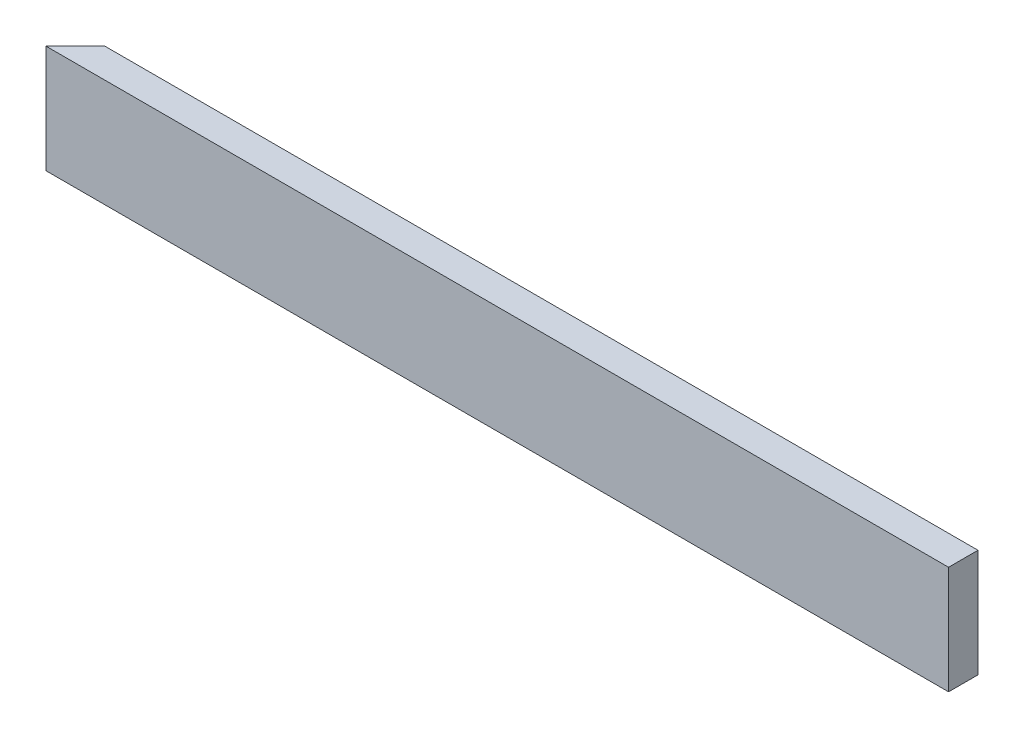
ISO-10303-21;
HEADER;
FILE_DESCRIPTION(('STEP AP214'),'2;1');
FILE_NAME('part.step','',(''),(''),'','','');
FILE_SCHEMA(('AUTOMOTIVE_DESIGN { 1 0 10303 214 1 1 1 1 }'));
ENDSEC;
DATA;
#1=APPLICATION_CONTEXT('core data for automotive mechanical design processes');
#2=APPLICATION_PROTOCOL_DEFINITION('international standard','automotive_design',2000,#1);
#3=PRODUCT_CONTEXT('',#1,'mechanical');
#4=PRODUCT('Part','Part','',(#3));
#5=PRODUCT_RELATED_PRODUCT_CATEGORY('part','',(#4));
#6=PRODUCT_DEFINITION_FORMATION('','',#4);
#7=PRODUCT_DEFINITION_CONTEXT('part definition',#1,'design');
#8=PRODUCT_DEFINITION('design','',#6,#7);
#9=PRODUCT_DEFINITION_SHAPE('','',#8);
#10=(LENGTH_UNIT() NAMED_UNIT(*) SI_UNIT(.MILLI.,.METRE.));
#11=(NAMED_UNIT(*) PLANE_ANGLE_UNIT() SI_UNIT($,.RADIAN.));
#12=(NAMED_UNIT(*) SI_UNIT($,.STERADIAN.) SOLID_ANGLE_UNIT());
#13=UNCERTAINTY_MEASURE_WITH_UNIT(LENGTH_MEASURE(1.E-05),#10,'distance_accuracy_value','');
#14=(GEOMETRIC_REPRESENTATION_CONTEXT(3) GLOBAL_UNCERTAINTY_ASSIGNED_CONTEXT((#13)) GLOBAL_UNIT_ASSIGNED_CONTEXT((#10,
#11,#12)) REPRESENTATION_CONTEXT('',''));
#15=CARTESIAN_POINT('',(0.,0.,0.));
#16=DIRECTION('',(0.,0.,1.));
#17=DIRECTION('',(1.,0.,0.));
#18=AXIS2_PLACEMENT_3D('',#15,#16,#17);
#19=CARTESIAN_POINT('',(-1130.3,139.7,0.));
#20=DIRECTION('',(0.,0.,1.));
#21=DIRECTION('',(1.,0.,0.));
#22=AXIS2_PLACEMENT_3D('',#19,#20,#21);
#23=PLANE('',#22);
#24=DIRECTION('',(-1.,0.,0.));
#25=VECTOR('',#24,1.);
#26=CARTESIAN_POINT('',(-1130.3,0.,0.));
#27=LINE('',#26,#25);
#28=CARTESIAN_POINT('',(0.,0.,0.));
#29=VERTEX_POINT('',#28);
#30=CARTESIAN_POINT('',(-1130.3,0.,0.));
#31=VERTEX_POINT('',#30);
#32=EDGE_CURVE('E102',#29,#31,#27,.T.);
#33=ORIENTED_EDGE('',*,*,#32,.T.);
#34=DIRECTION('',(0.,-1.,0.));
#35=VECTOR('',#34,1.);
#36=CARTESIAN_POINT('',(-1130.3,139.7,0.));
#37=LINE('',#36,#35);
#38=CARTESIAN_POINT('',(-1130.3,139.7,0.));
#39=VERTEX_POINT('',#38);
#40=EDGE_CURVE('E11',#39,#31,#37,.T.);
#41=ORIENTED_EDGE('',*,*,#40,.F.);
#42=DIRECTION('',(-1.,0.,0.));
#43=VECTOR('',#42,1.);
#44=CARTESIAN_POINT('',(-1130.3,139.7,0.));
#45=LINE('',#44,#43);
#46=CARTESIAN_POINT('',(0.,139.7,0.));
#47=VERTEX_POINT('',#46);
#48=EDGE_CURVE('E90',#47,#39,#45,.T.);
#49=ORIENTED_EDGE('',*,*,#48,.F.);
#50=DIRECTION('',(0.,-1.,0.));
#51=VECTOR('',#50,1.);
#52=CARTESIAN_POINT('',(0.,139.7,0.));
#53=LINE('',#52,#51);
#54=EDGE_CURVE('E98',#47,#29,#53,.T.);
#55=ORIENTED_EDGE('',*,*,#54,.T.);
#56=EDGE_LOOP('',(#33,#41,#49,#55));
#57=FACE_BOUND('',#56,.T.);
#58=ADVANCED_FACE('F39',(#57),#23,.F.);
#59=CARTESIAN_POINT('',(-1168.4,139.7,38.1000000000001));
#60=DIRECTION('',(0.707106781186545,0.,0.707106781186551));
#61=DIRECTION('',(0.707106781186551,0.,-0.707106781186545));
#62=AXIS2_PLACEMENT_3D('',#59,#60,#61);
#63=PLANE('',#62);
#64=DIRECTION('',(-0.707106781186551,0.,0.707106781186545));
#65=VECTOR('',#64,1.);
#66=CARTESIAN_POINT('',(-1168.4,0.,38.1000000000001));
#67=LINE('',#66,#65);
#68=CARTESIAN_POINT('',(-1168.4,0.,38.1000000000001));
#69=VERTEX_POINT('',#68);
#70=EDGE_CURVE('E94',#31,#69,#67,.T.);
#71=ORIENTED_EDGE('',*,*,#70,.T.);
#72=DIRECTION('',(0.,-1.,0.));
#73=VECTOR('',#72,1.);
#74=CARTESIAN_POINT('',(-1168.4,139.7,38.1000000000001));
#75=LINE('',#74,#73);
#76=CARTESIAN_POINT('',(-1168.4,139.7,38.1000000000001));
#77=VERTEX_POINT('',#76);
#78=EDGE_CURVE('E47',#77,#69,#75,.T.);
#79=ORIENTED_EDGE('',*,*,#78,.F.);
#80=DIRECTION('',(-0.707106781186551,0.,0.707106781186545));
#81=VECTOR('',#80,1.);
#82=CARTESIAN_POINT('',(-1168.4,139.7,38.1000000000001));
#83=LINE('',#82,#81);
#84=EDGE_CURVE('E85',#39,#77,#83,.T.);
#85=ORIENTED_EDGE('',*,*,#84,.F.);
#86=ORIENTED_EDGE('',*,*,#40,.T.);
#87=EDGE_LOOP('',(#71,#79,#85,#86));
#88=FACE_BOUND('',#87,.T.);
#89=ADVANCED_FACE('F93',(#88),#63,.F.);
#90=CARTESIAN_POINT('',(0.,139.7,38.1));
#91=DIRECTION('',(0.,0.,-1.));
#92=DIRECTION('',(-1.,0.,0.));
#93=AXIS2_PLACEMENT_3D('',#90,#91,#92);
#94=PLANE('',#93);
#95=DIRECTION('',(1.,0.,0.));
#96=VECTOR('',#95,1.);
#97=CARTESIAN_POINT('',(0.,0.,38.1));
#98=LINE('',#97,#96);
#99=CARTESIAN_POINT('',(0.,0.,38.1));
#100=VERTEX_POINT('',#99);
#101=EDGE_CURVE('E72',#69,#100,#98,.T.);
#102=ORIENTED_EDGE('',*,*,#101,.T.);
#103=DIRECTION('',(0.,-1.,0.));
#104=VECTOR('',#103,1.);
#105=CARTESIAN_POINT('',(0.,139.7,38.1));
#106=LINE('',#105,#104);
#107=CARTESIAN_POINT('',(0.,139.7,38.1));
#108=VERTEX_POINT('',#107);
#109=EDGE_CURVE('E95',#108,#100,#106,.T.);
#110=ORIENTED_EDGE('',*,*,#109,.F.);
#111=DIRECTION('',(1.,0.,0.));
#112=VECTOR('',#111,1.);
#113=CARTESIAN_POINT('',(0.,139.7,38.1));
#114=LINE('',#113,#112);
#115=EDGE_CURVE('E88',#77,#108,#114,.T.);
#116=ORIENTED_EDGE('',*,*,#115,.F.);
#117=ORIENTED_EDGE('',*,*,#78,.T.);
#118=EDGE_LOOP('',(#102,#110,#116,#117));
#119=FACE_BOUND('',#118,.T.);
#120=ADVANCED_FACE('F96',(#119),#94,.F.);
#121=CARTESIAN_POINT('',(0.,139.7,0.));
#122=DIRECTION('',(-1.,0.,0.));
#123=DIRECTION('',(0.,0.,1.));
#124=AXIS2_PLACEMENT_3D('',#121,#122,#123);
#125=PLANE('',#124);
#126=DIRECTION('',(0.,0.,-1.));
#127=VECTOR('',#126,1.);
#128=CARTESIAN_POINT('',(0.,0.,0.));
#129=LINE('',#128,#127);
#130=EDGE_CURVE('E78',#100,#29,#129,.T.);
#131=ORIENTED_EDGE('',*,*,#130,.T.);
#132=ORIENTED_EDGE('',*,*,#54,.F.);
#133=DIRECTION('',(0.,0.,-1.));
#134=VECTOR('',#133,1.);
#135=CARTESIAN_POINT('',(0.,139.7,0.));
#136=LINE('',#135,#134);
#137=EDGE_CURVE('E55',#108,#47,#136,.T.);
#138=ORIENTED_EDGE('',*,*,#137,.F.);
#139=ORIENTED_EDGE('',*,*,#109,.T.);
#140=EDGE_LOOP('',(#131,#132,#138,#139));
#141=FACE_BOUND('',#140,.T.);
#142=ADVANCED_FACE('F109',(#141),#125,.F.);
#143=CARTESIAN_POINT('',(0.,139.7,0.));
#144=DIRECTION('',(0.,-1.,0.));
#145=DIRECTION('',(0.,0.,-1.));
#146=AXIS2_PLACEMENT_3D('',#143,#144,#145);
#147=PLANE('',#146);
#148=ORIENTED_EDGE('',*,*,#48,.T.);
#149=ORIENTED_EDGE('',*,*,#84,.T.);
#150=ORIENTED_EDGE('',*,*,#115,.T.);
#151=ORIENTED_EDGE('',*,*,#137,.T.);
#152=EDGE_LOOP('',(#148,#149,#150,#151));
#153=FACE_BOUND('',#152,.T.);
#154=ADVANCED_FACE('F86',(#153),#147,.F.);
#155=CARTESIAN_POINT('',(0.,0.,0.));
#156=DIRECTION('',(0.,-1.,0.));
#157=DIRECTION('',(0.,0.,-1.));
#158=AXIS2_PLACEMENT_3D('',#155,#156,#157);
#159=PLANE('',#158);
#160=ORIENTED_EDGE('',*,*,#32,.F.);
#161=ORIENTED_EDGE('',*,*,#130,.F.);
#162=ORIENTED_EDGE('',*,*,#101,.F.);
#163=ORIENTED_EDGE('',*,*,#70,.F.);
#164=EDGE_LOOP('',(#160,#161,#162,#163));
#165=FACE_BOUND('',#164,.T.);
#166=ADVANCED_FACE('F112',(#165),#159,.T.);
#167=CLOSED_SHELL('',(#58,#89,#120,#142,#154,#166));
#168=MANIFOLD_SOLID_BREP('B2',#167);
#169=ADVANCED_BREP_SHAPE_REPRESENTATION('',(#18,#168),#14);
#170=SHAPE_DEFINITION_REPRESENTATION(#9,#169);
ENDSEC;
END-ISO-10303-21;
